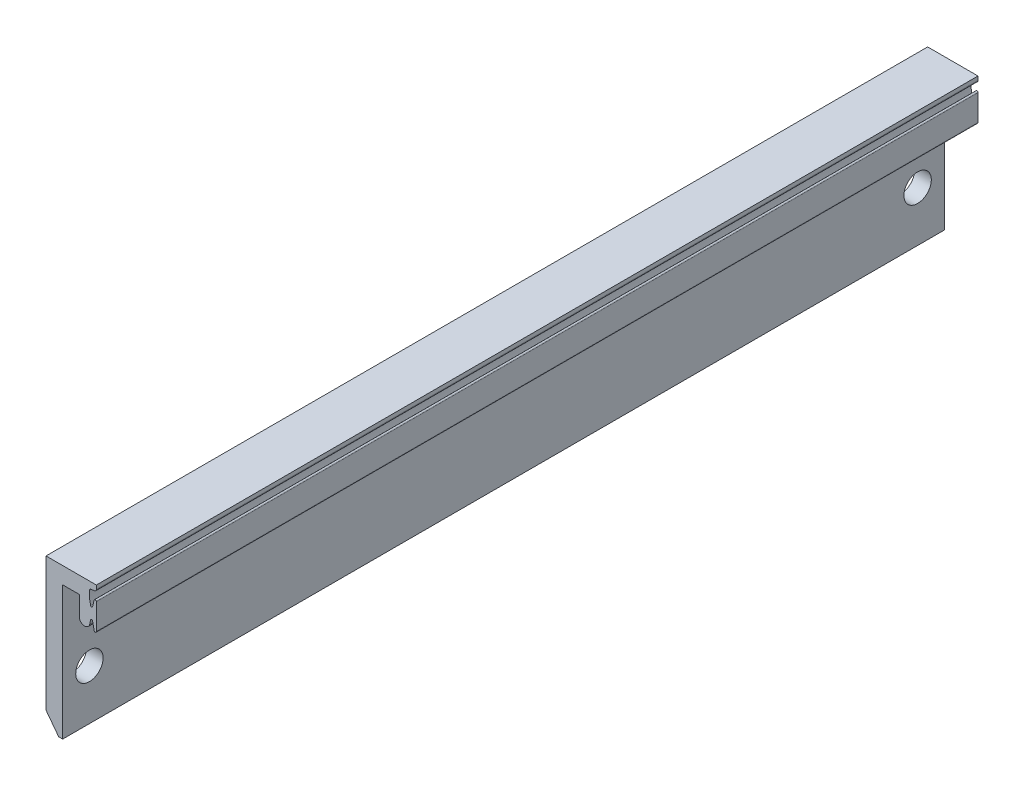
from build123d import *

# Parameters (mm, degrees)
EXTRUDE_1_DEPTH     = 66
SKETCH_2_R          = 2.05
CUT_EXTRUDE_1_DEPTH = 3260.054192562


with BuildPart() as part:
    # Sketch 1 → Extrude 1 (new, symmetric)
    with BuildSketch(Plane.XY):
        with BuildLine():
            Line((2475.892586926, -3235.877107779), (2468.352586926, -3235.877107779))
            Line((2468.352586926, -3235.877107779), (2468.352586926, -3255.877107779))
            Line((2468.352586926, -3255.877107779), (2470.252586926, -3258.377107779))
            Line((2470.252586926, -3258.377107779), (2470.852586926, -3258.377107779))
            Line((2470.852586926, -3258.377107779), (2470.852586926, -3238.377107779))
            Line((2470.852586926, -3238.377107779), (2473.352586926, -3238.377107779))
            Line((2473.352586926, -3238.377107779), (2473.352586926, -3241.243397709))
            Line((2473.352586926, -3241.243397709), (2473.352586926, -3241.293845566))
            ThreePointArc((2473.352586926, -3241.293845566), (2474.054120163, -3242.072633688), (2474.901701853, -3241.455977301))
            Line((2474.901701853, -3241.455977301), (2475.034328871, -3240.829314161))
            ThreePointArc((2475.034328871, -3240.829314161), (2475.03583749, -3240.821049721), (2475.037806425, -3240.812882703))
            ThreePointArc((2475.037806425, -3240.812882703), (2475.187472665, -3240.702187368), (2475.32961412, -3240.82239239))
            Line((2475.32961412, -3240.82239239), (2475.555828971, -3241.941668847))
            ThreePointArc((2475.555828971, -3241.941668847), (2475.742824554, -3242.076887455), (2475.892586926, -3241.901323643))
            Line((2475.892586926, -3241.901323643), (2475.892586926, -3241.864607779))
            Line((2475.892586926, -3241.864607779), (2475.892586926, -3238.052891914))
            Line((2475.892586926, -3238.052891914), (2475.892586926, -3238.039607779))
            ThreePointArc((2475.892586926, -3238.039607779), (2475.738732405, -3237.876887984), (2475.556904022, -3238.007606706))
            Line((2475.556904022, -3238.007606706), (2475.328666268, -3238.986178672))
            ThreePointArc((2475.328666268, -3238.986178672), (2475.174172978, -3239.101871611), (2475.03361058, -3238.969602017))
            ThreePointArc((2475.03361058, -3238.969602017), (2474.869641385, -3238.052288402), (2474.839643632, -3237.120918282))
            ThreePointArc((2474.839643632, -3237.120918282), (2474.914894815, -3236.933969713), (2475.091454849, -3236.836814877))
            Line((2475.091454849, -3236.836814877), (2475.640533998, -3236.747916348))
            ThreePointArc((2475.640533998, -3236.747916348), (2475.821042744, -3236.646215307), (2475.892586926, -3236.45177267))
            Line((2475.892586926, -3236.45177267), (2475.892586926, -3235.877107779))
        make_face()
    extrude(amount=EXTRUDE_1_DEPTH, both=True)

    # Sketch 2 → Cut-Extrude 1 (cut, through all)
    with BuildSketch(Plane.ZY.offset(-2468.352586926)):
        with Locations(Location((-62, -3250.877107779, 0), (0, 0, 270))):
            Circle(SKETCH_2_R)
        with Locations(Location((62, -3250.877107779, 0), (0, 0, 90))):
            Circle(SKETCH_2_R)
    extrude(amount=-CUT_EXTRUDE_1_DEPTH, mode=Mode.SUBTRACT)


solid = part.part
